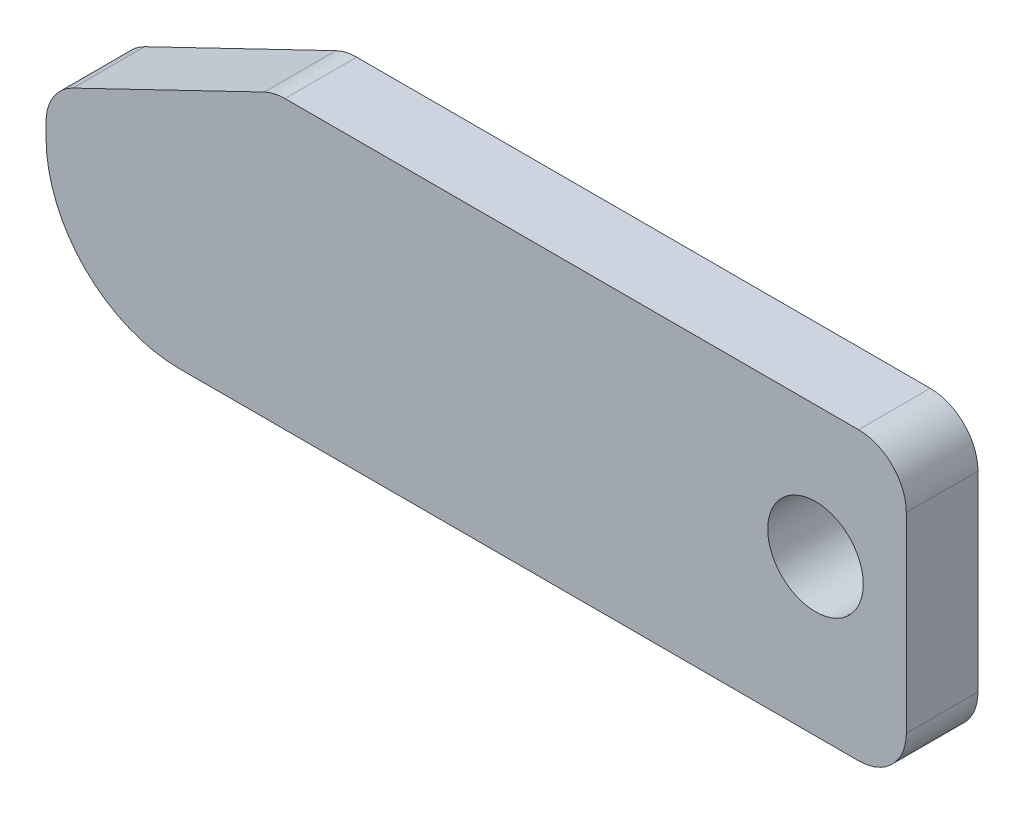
from build123d import *

# Parameters (mm, degrees)
ESQUISSE1_R          = 10
BASE_EXTRUSION_DEPTH = 15


with BuildPart() as part:
    # Esquisse1 → Base-Extrusion (new body)
    with BuildSketch(Plane.XY):
        with BuildLine():
            Line((-134.342109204, 59.008112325), (-174.342109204, 39.727228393))
            ThreePointArc((-174.342109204, 39.727228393), (-178.468207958, 36.037899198), (-180, 30.719116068))
            Line((-180, 30.719116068), (-180, 28))
            ThreePointArc((-180, 28), (-171.798989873, 8.201010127), (-152, 0))
            Line((-152, 0), (-10, 0))
            ThreePointArc((-10, 0), (-2.928932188, 2.928932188), (0, 10))
            Line((0, 10), (0, 50))
            ThreePointArc((0, 50), (-2.928932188, 57.071067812), (-10, 60))
            Line((-10, 60), (-130, 60))
            ThreePointArc((-130, 60), (-132.226979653, 59.74887489), (-134.342109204, 59.008112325))
        make_face()
        with Locations((-19, 32.5)):
            Circle(ESQUISSE1_R, mode=Mode.SUBTRACT)
    extrude(amount=BASE_EXTRUSION_DEPTH)


solid = part.part
